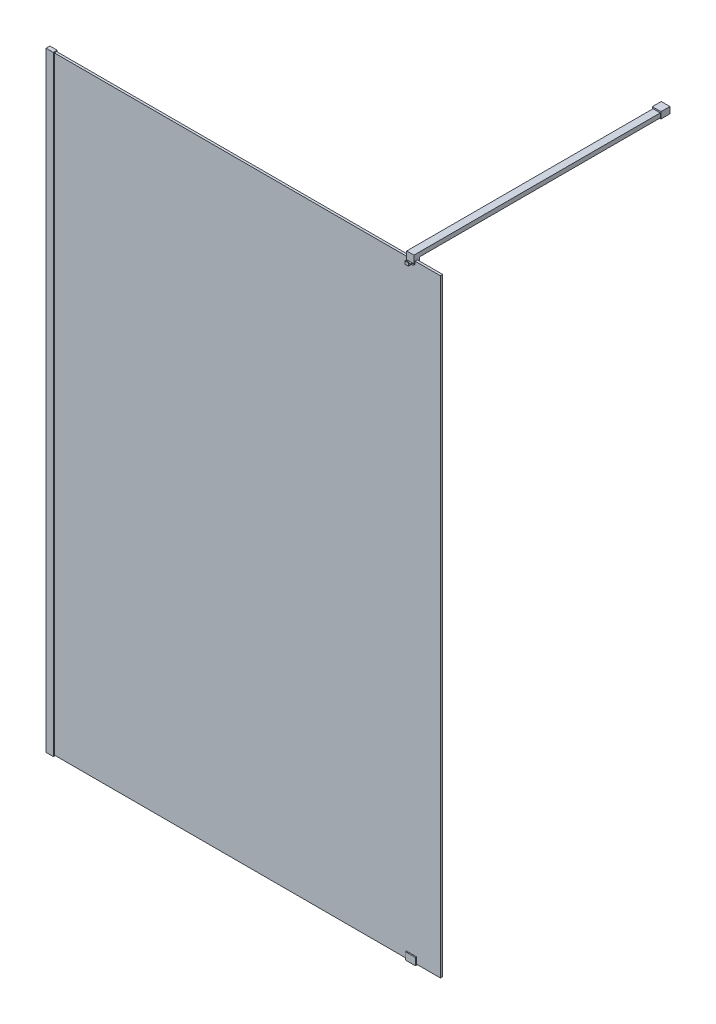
ISO-10303-21;
HEADER;
FILE_DESCRIPTION(('STEP AP214'),'2;1');
FILE_NAME('part.step','',(''),(''),'','','');
FILE_SCHEMA(('AUTOMOTIVE_DESIGN { 1 0 10303 214 1 1 1 1 }'));
ENDSEC;
DATA;
#1=APPLICATION_CONTEXT('core data for automotive mechanical design processes');
#2=APPLICATION_PROTOCOL_DEFINITION('international standard','automotive_design',2000,#1);
#3=PRODUCT_CONTEXT('',#1,'mechanical');
#4=PRODUCT('Part','Part','',(#3));
#5=PRODUCT_RELATED_PRODUCT_CATEGORY('part','',(#4));
#6=PRODUCT_DEFINITION_FORMATION('','',#4);
#7=PRODUCT_DEFINITION_CONTEXT('part definition',#1,'design');
#8=PRODUCT_DEFINITION('design','',#6,#7);
#9=PRODUCT_DEFINITION_SHAPE('','',#8);
#10=(LENGTH_UNIT() NAMED_UNIT(*) SI_UNIT(.MILLI.,.METRE.));
#11=(NAMED_UNIT(*) PLANE_ANGLE_UNIT() SI_UNIT($,.RADIAN.));
#12=(NAMED_UNIT(*) SI_UNIT($,.STERADIAN.) SOLID_ANGLE_UNIT());
#13=UNCERTAINTY_MEASURE_WITH_UNIT(LENGTH_MEASURE(1.E-05),#10,'distance_accuracy_value','');
#14=(GEOMETRIC_REPRESENTATION_CONTEXT(3) GLOBAL_UNCERTAINTY_ASSIGNED_CONTEXT((#13)) GLOBAL_UNIT_ASSIGNED_CONTEXT((#10,
#11,#12)) REPRESENTATION_CONTEXT('',''));
#15=CARTESIAN_POINT('',(0.,0.,0.));
#16=DIRECTION('',(0.,0.,1.));
#17=DIRECTION('',(1.,0.,0.));
#18=AXIS2_PLACEMENT_3D('',#15,#16,#17);
#19=CARTESIAN_POINT('',(1270.95,2090.,-19.4000000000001));
#20=DIRECTION('',(-1.,0.,0.));
#21=DIRECTION('',(0.,0.,1.));
#22=AXIS2_PLACEMENT_3D('',#19,#20,#21);
#23=PLANE('',#22);
#24=DIRECTION('',(0.,-1.,0.));
#25=VECTOR('',#24,1.);
#26=CARTESIAN_POINT('',(1270.95,2090.,-850.03));
#27=LINE('',#26,#25);
#28=CARTESIAN_POINT('',(1270.95,2120.,-850.03));
#29=VERTEX_POINT('',#28);
#30=CARTESIAN_POINT('',(1270.95,2105.,-850.03));
#31=VERTEX_POINT('',#30);
#32=EDGE_CURVE('E61',#29,#31,#27,.T.);
#33=ORIENTED_EDGE('',*,*,#32,.F.);
#34=DIRECTION('',(0.,0.,1.));
#35=VECTOR('',#34,1.);
#36=CARTESIAN_POINT('',(1270.95,2120.,0.599999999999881));
#37=LINE('',#36,#35);
#38=CARTESIAN_POINT('',(1270.95,2120.,0.599999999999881));
#39=VERTEX_POINT('',#38);
#40=EDGE_CURVE('E386',#29,#39,#37,.T.);
#41=ORIENTED_EDGE('',*,*,#40,.T.);
#42=DIRECTION('',(0.,-1.,0.));
#43=VECTOR('',#42,1.);
#44=CARTESIAN_POINT('',(1270.95,2094.,0.599999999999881));
#45=LINE('',#44,#43);
#46=CARTESIAN_POINT('',(1270.95,2094.,0.599999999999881));
#47=VERTEX_POINT('',#46);
#48=EDGE_CURVE('E388',#39,#47,#45,.T.);
#49=ORIENTED_EDGE('',*,*,#48,.T.);
#50=DIRECTION('',(0.,1.,0.));
#51=VECTOR('',#50,1.);
#52=CARTESIAN_POINT('',(1270.95,2090.,0.599999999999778));
#53=LINE('',#52,#51);
#54=CARTESIAN_POINT('',(1270.95,2090.,0.599999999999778));
#55=VERTEX_POINT('',#54);
#56=EDGE_CURVE('E332',#55,#47,#53,.T.);
#57=ORIENTED_EDGE('',*,*,#56,.F.);
#58=DIRECTION('',(0.,0.,-1.));
#59=VECTOR('',#58,1.);
#60=CARTESIAN_POINT('',(1270.95,2090.,-3.40000000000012));
#61=LINE('',#60,#59);
#62=CARTESIAN_POINT('',(1270.95,2090.,-3.40000000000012));
#63=VERTEX_POINT('',#62);
#64=EDGE_CURVE('E362',#55,#63,#61,.T.);
#65=ORIENTED_EDGE('',*,*,#64,.T.);
#66=DIRECTION('',(0.,1.,-1.30407837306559E-13));
#67=VECTOR('',#66,1.);
#68=CARTESIAN_POINT('',(1270.95,2100.,-3.40000000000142));
#69=LINE('',#68,#67);
#70=CARTESIAN_POINT('',(1270.95,2100.,-3.40000000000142));
#71=VERTEX_POINT('',#70);
#72=EDGE_CURVE('E392',#63,#71,#69,.T.);
#73=ORIENTED_EDGE('',*,*,#72,.T.);
#74=DIRECTION('',(0.,0.,-1.));
#75=VECTOR('',#74,1.);
#76=CARTESIAN_POINT('',(1270.95,2100.,-11.4000000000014));
#77=LINE('',#76,#75);
#78=CARTESIAN_POINT('',(1270.95,2100.,-11.4000000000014));
#79=VERTEX_POINT('',#78);
#80=EDGE_CURVE('E394',#71,#79,#77,.T.);
#81=ORIENTED_EDGE('',*,*,#80,.T.);
#82=DIRECTION('',(0.,-1.,1.30451205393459E-13));
#83=VECTOR('',#82,1.);
#84=CARTESIAN_POINT('',(1270.95,2090.,-11.4000000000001));
#85=LINE('',#84,#83);
#86=CARTESIAN_POINT('',(1270.95,2090.,-11.4000000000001));
#87=VERTEX_POINT('',#86);
#88=EDGE_CURVE('E395',#79,#87,#85,.T.);
#89=ORIENTED_EDGE('',*,*,#88,.T.);
#90=DIRECTION('',(0.,0.,-1.));
#91=VECTOR('',#90,1.);
#92=CARTESIAN_POINT('',(1270.95,2090.,-19.4000000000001));
#93=LINE('',#92,#91);
#94=CARTESIAN_POINT('',(1270.95,2090.,-19.4000000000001));
#95=VERTEX_POINT('',#94);
#96=EDGE_CURVE('E283',#87,#95,#93,.T.);
#97=ORIENTED_EDGE('',*,*,#96,.T.);
#98=DIRECTION('',(0.,1.,0.));
#99=VECTOR('',#98,1.);
#100=CARTESIAN_POINT('',(1270.95,2120.,-19.4000000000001));
#101=LINE('',#100,#99);
#102=CARTESIAN_POINT('',(1270.95,2105.,-19.4000000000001));
#103=VERTEX_POINT('',#102);
#104=EDGE_CURVE('E249',#95,#103,#101,.T.);
#105=ORIENTED_EDGE('',*,*,#104,.T.);
#106=DIRECTION('',(0.,0.,-1.));
#107=VECTOR('',#106,1.);
#108=CARTESIAN_POINT('',(1270.95,2105.,-881.03));
#109=LINE('',#108,#107);
#110=EDGE_CURVE('E248',#103,#31,#109,.T.);
#111=ORIENTED_EDGE('',*,*,#110,.T.);
#112=EDGE_LOOP('',(#33,#41,#49,#57,#65,#73,#81,#89,#97,#105,#111));
#113=FACE_BOUND('',#112,.T.);
#114=ADVANCED_FACE('F46',(#113),#23,.F.);
#115=CARTESIAN_POINT('',(1245.95,2090.,-19.4000000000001));
#116=DIRECTION('',(-1.,0.,0.));
#117=DIRECTION('',(0.,0.,1.));
#118=AXIS2_PLACEMENT_3D('',#115,#116,#117);
#119=PLANE('',#118);
#120=DIRECTION('',(0.,0.,1.));
#121=VECTOR('',#120,1.);
#122=CARTESIAN_POINT('',(1245.95,2120.,0.599999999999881));
#123=LINE('',#122,#121);
#124=CARTESIAN_POINT('',(1245.95,2120.,-850.03));
#125=VERTEX_POINT('',#124);
#126=CARTESIAN_POINT('',(1245.95,2120.,0.599999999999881));
#127=VERTEX_POINT('',#126);
#128=EDGE_CURVE('E272',#125,#127,#123,.T.);
#129=ORIENTED_EDGE('',*,*,#128,.F.);
#130=DIRECTION('',(0.,-1.,0.));
#131=VECTOR('',#130,1.);
#132=CARTESIAN_POINT('',(1245.95,2090.,-850.03));
#133=LINE('',#132,#131);
#134=CARTESIAN_POINT('',(1245.95,2105.,-850.03));
#135=VERTEX_POINT('',#134);
#136=EDGE_CURVE('E230',#125,#135,#133,.T.);
#137=ORIENTED_EDGE('',*,*,#136,.T.);
#138=DIRECTION('',(0.,0.,1.));
#139=VECTOR('',#138,1.);
#140=CARTESIAN_POINT('',(1245.95,2105.,-881.03));
#141=LINE('',#140,#139);
#142=CARTESIAN_POINT('',(1245.95,2105.,-19.4000000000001));
#143=VERTEX_POINT('',#142);
#144=EDGE_CURVE('E238',#135,#143,#141,.T.);
#145=ORIENTED_EDGE('',*,*,#144,.T.);
#146=DIRECTION('',(0.,1.,0.));
#147=VECTOR('',#146,1.);
#148=CARTESIAN_POINT('',(1245.95,2120.,-19.4000000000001));
#149=LINE('',#148,#147);
#150=CARTESIAN_POINT('',(1245.95,2090.,-19.4000000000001));
#151=VERTEX_POINT('',#150);
#152=EDGE_CURVE('E262',#151,#143,#149,.T.);
#153=ORIENTED_EDGE('',*,*,#152,.F.);
#154=DIRECTION('',(0.,0.,-1.));
#155=VECTOR('',#154,1.);
#156=CARTESIAN_POINT('',(1245.95,2090.,-19.4000000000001));
#157=LINE('',#156,#155);
#158=CARTESIAN_POINT('',(1245.95,2090.,-11.4000000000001));
#159=VERTEX_POINT('',#158);
#160=EDGE_CURVE('E296',#159,#151,#157,.T.);
#161=ORIENTED_EDGE('',*,*,#160,.F.);
#162=DIRECTION('',(0.,-1.,1.30451205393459E-13));
#163=VECTOR('',#162,1.);
#164=CARTESIAN_POINT('',(1245.95,2090.,-11.4000000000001));
#165=LINE('',#164,#163);
#166=CARTESIAN_POINT('',(1245.95,2100.,-11.4000000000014));
#167=VERTEX_POINT('',#166);
#168=EDGE_CURVE('E294',#167,#159,#165,.T.);
#169=ORIENTED_EDGE('',*,*,#168,.F.);
#170=DIRECTION('',(0.,0.,-1.));
#171=VECTOR('',#170,1.);
#172=CARTESIAN_POINT('',(1245.95,2100.,-11.4000000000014));
#173=LINE('',#172,#171);
#174=CARTESIAN_POINT('',(1245.95,2100.,-3.40000000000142));
#175=VERTEX_POINT('',#174);
#176=EDGE_CURVE('E292',#175,#167,#173,.T.);
#177=ORIENTED_EDGE('',*,*,#176,.F.);
#178=DIRECTION('',(0.,1.,-1.30407837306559E-13));
#179=VECTOR('',#178,1.);
#180=CARTESIAN_POINT('',(1245.95,2100.,-3.40000000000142));
#181=LINE('',#180,#179);
#182=CARTESIAN_POINT('',(1245.95,2090.,-3.40000000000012));
#183=VERTEX_POINT('',#182);
#184=EDGE_CURVE('E290',#183,#175,#181,.T.);
#185=ORIENTED_EDGE('',*,*,#184,.F.);
#186=DIRECTION('',(0.,0.,-1.));
#187=VECTOR('',#186,1.);
#188=CARTESIAN_POINT('',(1245.95,2090.,-3.40000000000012));
#189=LINE('',#188,#187);
#190=CARTESIAN_POINT('',(1245.95,2090.,0.599999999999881));
#191=VERTEX_POINT('',#190);
#192=EDGE_CURVE('E288',#191,#183,#189,.T.);
#193=ORIENTED_EDGE('',*,*,#192,.F.);
#194=DIRECTION('',(0.,1.,0.));
#195=VECTOR('',#194,1.);
#196=CARTESIAN_POINT('',(1245.95,2090.,0.599999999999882));
#197=LINE('',#196,#195);
#198=CARTESIAN_POINT('',(1245.95,2094.,0.599999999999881));
#199=VERTEX_POINT('',#198);
#200=EDGE_CURVE('E329',#191,#199,#197,.T.);
#201=ORIENTED_EDGE('',*,*,#200,.T.);
#202=DIRECTION('',(0.,-1.,0.));
#203=VECTOR('',#202,1.);
#204=CARTESIAN_POINT('',(1245.95,2094.,0.599999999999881));
#205=LINE('',#204,#203);
#206=EDGE_CURVE('E274',#127,#199,#205,.T.);
#207=ORIENTED_EDGE('',*,*,#206,.F.);
#208=EDGE_LOOP('',(#129,#137,#145,#153,#161,#169,#177,#185,#193,#201,#207));
#209=FACE_BOUND('',#208,.T.);
#210=ADVANCED_FACE('F259',(#209),#119,.T.);
#211=CARTESIAN_POINT('',(1270.95,2120.,0.599999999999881));
#212=DIRECTION('',(0.,-1.,0.));
#213=DIRECTION('',(0.,0.,-1.));
#214=AXIS2_PLACEMENT_3D('',#211,#212,#213);
#215=PLANE('',#214);
#216=DIRECTION('',(1.,0.,0.));
#217=VECTOR('',#216,1.);
#218=CARTESIAN_POINT('',(1270.95,2120.,-850.03));
#219=LINE('',#218,#217);
#220=EDGE_CURVE('E68',#125,#29,#219,.T.);
#221=ORIENTED_EDGE('',*,*,#220,.F.);
#222=ORIENTED_EDGE('',*,*,#128,.T.);
#223=DIRECTION('',(-1.,0.,0.));
#224=VECTOR('',#223,1.);
#225=CARTESIAN_POINT('',(1270.95,2120.,0.599999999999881));
#226=LINE('',#225,#224);
#227=EDGE_CURVE('E326',#39,#127,#226,.T.);
#228=ORIENTED_EDGE('',*,*,#227,.F.);
#229=ORIENTED_EDGE('',*,*,#40,.F.);
#230=EDGE_LOOP('',(#221,#222,#228,#229));
#231=FACE_BOUND('',#230,.T.);
#232=ADVANCED_FACE('F437',(#231),#215,.F.);
#233=CARTESIAN_POINT('',(1245.95,2105.,-19.4000000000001));
#234=DIRECTION('',(0.,1.,0.));
#235=DIRECTION('',(0.,0.,1.));
#236=AXIS2_PLACEMENT_3D('',#233,#234,#235);
#237=PLANE('',#236);
#238=DIRECTION('',(-1.,0.,0.));
#239=VECTOR('',#238,1.);
#240=CARTESIAN_POINT('',(1245.95,2105.,-850.03));
#241=LINE('',#240,#239);
#242=EDGE_CURVE('E12',#31,#135,#241,.T.);
#243=ORIENTED_EDGE('',*,*,#242,.F.);
#244=ORIENTED_EDGE('',*,*,#110,.F.);
#245=DIRECTION('',(1.,0.,0.));
#246=VECTOR('',#245,1.);
#247=CARTESIAN_POINT('',(1245.95,2105.,-19.4000000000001));
#248=LINE('',#247,#246);
#249=EDGE_CURVE('E244',#143,#103,#248,.T.);
#250=ORIENTED_EDGE('',*,*,#249,.F.);
#251=ORIENTED_EDGE('',*,*,#144,.F.);
#252=EDGE_LOOP('',(#243,#244,#250,#251));
#253=FACE_BOUND('',#252,.T.);
#254=ADVANCED_FACE('F265',(#253),#237,.F.);
#255=CARTESIAN_POINT('',(1270.95,2094.,9.84506801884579));
#256=DIRECTION('',(0.,-1.,0.));
#257=DIRECTION('',(0.,0.,-1.));
#258=AXIS2_PLACEMENT_3D('',#255,#256,#257);
#259=PLANE('',#258);
#260=DIRECTION('',(-0.906307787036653,0.,-0.422618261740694));
#261=VECTOR('',#260,1.);
#262=CARTESIAN_POINT('',(1270.02591161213,2094.,11.8267819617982));
#263=LINE('',#262,#261);
#264=CARTESIAN_POINT('',(1252.45,2094.,3.6309997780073));
#265=VERTEX_POINT('',#264);
#266=EDGE_CURVE('E365',#265,#199,#263,.T.);
#267=ORIENTED_EDGE('',*,*,#266,.F.);
#268=DIRECTION('',(0.,0.,-1.));
#269=VECTOR('',#268,1.);
#270=CARTESIAN_POINT('',(1252.45,2094.,9.84506801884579));
#271=LINE('',#270,#269);
#272=CARTESIAN_POINT('',(1252.45,2094.,9.84506801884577));
#273=VERTEX_POINT('',#272);
#274=EDGE_CURVE('E273',#273,#265,#271,.T.);
#275=ORIENTED_EDGE('',*,*,#274,.F.);
#276=DIRECTION('',(-1.,0.,0.));
#277=VECTOR('',#276,1.);
#278=CARTESIAN_POINT('',(1270.95,2094.,9.84506801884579));
#279=LINE('',#278,#277);
#280=CARTESIAN_POINT('',(1264.45,2094.,9.84506801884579));
#281=VERTEX_POINT('',#280);
#282=EDGE_CURVE('E320',#281,#273,#279,.T.);
#283=ORIENTED_EDGE('',*,*,#282,.F.);
#284=DIRECTION('',(0.,0.,1.));
#285=VECTOR('',#284,1.);
#286=CARTESIAN_POINT('',(1264.45,2094.,9.84506801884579));
#287=LINE('',#286,#285);
#288=CARTESIAN_POINT('',(1264.45,2094.,3.63099977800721));
#289=VERTEX_POINT('',#288);
#290=EDGE_CURVE('E379',#289,#281,#287,.T.);
#291=ORIENTED_EDGE('',*,*,#290,.F.);
#292=DIRECTION('',(-0.906307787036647,0.,0.422618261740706));
#293=VECTOR('',#292,1.);
#294=CARTESIAN_POINT('',(1267.40893350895,2094.,2.25122642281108));
#295=LINE('',#294,#293);
#296=EDGE_CURVE('E364',#47,#289,#295,.T.);
#297=ORIENTED_EDGE('',*,*,#296,.F.);
#298=DIRECTION('',(-1.,0.,0.));
#299=VECTOR('',#298,1.);
#300=CARTESIAN_POINT('',(1270.95,2094.,0.599999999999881));
#301=LINE('',#300,#299);
#302=EDGE_CURVE('E323',#47,#199,#301,.T.);
#303=ORIENTED_EDGE('',*,*,#302,.T.);
#304=EDGE_LOOP('',(#267,#275,#283,#291,#297,#303));
#305=FACE_BOUND('',#304,.T.);
#306=ADVANCED_FACE('F424',(#305),#259,.F.);
#307=CARTESIAN_POINT('',(1270.95,2100.,10.3700000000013));
#308=DIRECTION('',(0.,-0.087155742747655,0.996194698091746));
#309=DIRECTION('',(0.,-0.996194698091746,-0.087155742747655));
#310=AXIS2_PLACEMENT_3D('',#307,#308,#309);
#311=PLANE('',#310);
#312=DIRECTION('',(0.,-0.996194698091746,-0.087155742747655));
#313=VECTOR('',#312,1.);
#314=CARTESIAN_POINT('',(1252.45,2100.,10.3700000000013));
#315=LINE('',#314,#313);
#316=CARTESIAN_POINT('',(1252.45,2100.,10.3700000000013));
#317=VERTEX_POINT('',#316);
#318=EDGE_CURVE('E276',#317,#273,#315,.T.);
#319=ORIENTED_EDGE('',*,*,#318,.F.);
#320=DIRECTION('',(-1.,0.,0.));
#321=VECTOR('',#320,1.);
#322=CARTESIAN_POINT('',(1270.95,2100.,10.3700000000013));
#323=LINE('',#322,#321);
#324=CARTESIAN_POINT('',(1264.45,2100.,10.3700000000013));
#325=VERTEX_POINT('',#324);
#326=EDGE_CURVE('E317',#325,#317,#323,.T.);
#327=ORIENTED_EDGE('',*,*,#326,.F.);
#328=DIRECTION('',(0.,0.996194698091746,0.087155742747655));
#329=VECTOR('',#328,1.);
#330=CARTESIAN_POINT('',(1264.45,2100.,10.3700000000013));
#331=LINE('',#330,#329);
#332=EDGE_CURVE('E376',#281,#325,#331,.T.);
#333=ORIENTED_EDGE('',*,*,#332,.F.);
#334=ORIENTED_EDGE('',*,*,#282,.T.);
#335=EDGE_LOOP('',(#319,#327,#333,#334));
#336=FACE_BOUND('',#335,.T.);
#337=ADVANCED_FACE('F428',(#336),#311,.F.);
#338=CARTESIAN_POINT('',(1270.95,2100.,13.3700000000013));
#339=DIRECTION('',(0.,-1.,1.48029736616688E-13));
#340=DIRECTION('',(0.,-1.48029736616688E-13,-1.));
#341=AXIS2_PLACEMENT_3D('',#338,#339,#340);
#342=PLANE('',#341);
#343=DIRECTION('',(0.,-1.48029736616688E-13,-1.));
#344=VECTOR('',#343,1.);
#345=CARTESIAN_POINT('',(1252.45,2100.,13.3700000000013));
#346=LINE('',#345,#344);
#347=CARTESIAN_POINT('',(1252.45,2100.,13.3700000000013));
#348=VERTEX_POINT('',#347);
#349=EDGE_CURVE('E382',#348,#317,#346,.T.);
#350=ORIENTED_EDGE('',*,*,#349,.F.);
#351=DIRECTION('',(-1.,0.,0.));
#352=VECTOR('',#351,1.);
#353=CARTESIAN_POINT('',(1270.95,2100.,13.3700000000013));
#354=LINE('',#353,#352);
#355=CARTESIAN_POINT('',(1264.45,2100.,13.3700000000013));
#356=VERTEX_POINT('',#355);
#357=EDGE_CURVE('E314',#356,#348,#354,.T.);
#358=ORIENTED_EDGE('',*,*,#357,.F.);
#359=DIRECTION('',(0.,1.48029736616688E-13,1.));
#360=VECTOR('',#359,1.);
#361=CARTESIAN_POINT('',(1264.45,2100.,13.3700000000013));
#362=LINE('',#361,#360);
#363=EDGE_CURVE('E368',#325,#356,#362,.T.);
#364=ORIENTED_EDGE('',*,*,#363,.F.);
#365=ORIENTED_EDGE('',*,*,#326,.T.);
#366=EDGE_LOOP('',(#350,#358,#364,#365));
#367=FACE_BOUND('',#366,.T.);
#368=ADVANCED_FACE('F431',(#367),#342,.F.);
#369=CARTESIAN_POINT('',(1270.95,2090.,13.3700000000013));
#370=DIRECTION('',(0.,0.,-1.));
#371=DIRECTION('',(0.,1.,0.));
#372=AXIS2_PLACEMENT_3D('',#369,#370,#371);
#373=PLANE('',#372);
#374=ORIENTED_EDGE('',*,*,#357,.T.);
#375=DIRECTION('',(0.,-1.,0.));
#376=VECTOR('',#375,1.);
#377=CARTESIAN_POINT('',(1252.45,7879.54089163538,13.3700000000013));
#378=LINE('',#377,#376);
#379=CARTESIAN_POINT('',(1252.45,2090.,13.3700000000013));
#380=VERTEX_POINT('',#379);
#381=EDGE_CURVE('E345',#348,#380,#378,.T.);
#382=ORIENTED_EDGE('',*,*,#381,.T.);
#383=DIRECTION('',(-1.,0.,0.));
#384=VECTOR('',#383,1.);
#385=CARTESIAN_POINT('',(1270.95,2090.,13.3700000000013));
#386=LINE('',#385,#384);
#387=CARTESIAN_POINT('',(1264.45,2090.,13.3700000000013));
#388=VERTEX_POINT('',#387);
#389=EDGE_CURVE('E311',#388,#380,#386,.T.);
#390=ORIENTED_EDGE('',*,*,#389,.F.);
#391=DIRECTION('',(0.,-1.,0.));
#392=VECTOR('',#391,1.);
#393=CARTESIAN_POINT('',(1264.45,7879.54089163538,13.3700000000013));
#394=LINE('',#393,#392);
#395=EDGE_CURVE('E355',#356,#388,#394,.T.);
#396=ORIENTED_EDGE('',*,*,#395,.F.);
#397=EDGE_LOOP('',(#374,#382,#390,#396));
#398=FACE_BOUND('',#397,.T.);
#399=ADVANCED_FACE('F353',(#398),#373,.F.);
#400=CARTESIAN_POINT('',(1270.95,2090.,-3.40000000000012));
#401=DIRECTION('',(0.,1.,0.));
#402=DIRECTION('',(0.,0.,1.));
#403=AXIS2_PLACEMENT_3D('',#400,#401,#402);
#404=PLANE('',#403);
#405=DIRECTION('',(0.906307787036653,0.,0.422618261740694));
#406=VECTOR('',#405,1.);
#407=CARTESIAN_POINT('',(1264.95275623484,2090.,9.46113075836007));
#408=LINE('',#407,#406);
#409=CARTESIAN_POINT('',(1252.45,2090.,3.6309997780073));
#410=VERTEX_POINT('',#409);
#411=EDGE_CURVE('E370',#191,#410,#408,.T.);
#412=ORIENTED_EDGE('',*,*,#411,.F.);
#413=ORIENTED_EDGE('',*,*,#192,.T.);
#414=DIRECTION('',(-1.,0.,0.));
#415=VECTOR('',#414,1.);
#416=CARTESIAN_POINT('',(1270.95,2090.,-3.40000000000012));
#417=LINE('',#416,#415);
#418=EDGE_CURVE('E308',#63,#183,#417,.T.);
#419=ORIENTED_EDGE('',*,*,#418,.F.);
#420=ORIENTED_EDGE('',*,*,#64,.F.);
#421=DIRECTION('',(0.906307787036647,0.,-0.422618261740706));
#422=VECTOR('',#421,1.);
#423=CARTESIAN_POINT('',(1272.48208888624,2090.,-0.114424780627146));
#424=LINE('',#423,#422);
#425=CARTESIAN_POINT('',(1264.45,2090.,3.6309997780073));
#426=VERTEX_POINT('',#425);
#427=EDGE_CURVE('E360',#426,#55,#424,.T.);
#428=ORIENTED_EDGE('',*,*,#427,.F.);
#429=DIRECTION('',(0.,0.,-1.));
#430=VECTOR('',#429,1.);
#431=CARTESIAN_POINT('',(1264.45,2090.,-3.40000000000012));
#432=LINE('',#431,#430);
#433=EDGE_CURVE('E334',#388,#426,#432,.T.);
#434=ORIENTED_EDGE('',*,*,#433,.F.);
#435=ORIENTED_EDGE('',*,*,#389,.T.);
#436=DIRECTION('',(0.,0.,1.));
#437=VECTOR('',#436,1.);
#438=CARTESIAN_POINT('',(1252.45,2090.,-3.40000000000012));
#439=LINE('',#438,#437);
#440=EDGE_CURVE('E54',#410,#380,#439,.T.);
#441=ORIENTED_EDGE('',*,*,#440,.F.);
#442=EDGE_LOOP('',(#412,#413,#419,#420,#428,#434,#435,#441));
#443=FACE_BOUND('',#442,.T.);
#444=ADVANCED_FACE('F357',(#443),#404,.F.);
#445=CARTESIAN_POINT('',(1270.95,2120.,-19.4000000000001));
#446=DIRECTION('',(0.,0.,1.));
#447=DIRECTION('',(0.,-1.,0.));
#448=AXIS2_PLACEMENT_3D('',#445,#446,#447);
#449=PLANE('',#448);
#450=ORIENTED_EDGE('',*,*,#152,.T.);
#451=ORIENTED_EDGE('',*,*,#249,.T.);
#452=ORIENTED_EDGE('',*,*,#104,.F.);
#453=DIRECTION('',(-1.,0.,0.));
#454=VECTOR('',#453,1.);
#455=CARTESIAN_POINT('',(1270.95,2090.,-19.4000000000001));
#456=LINE('',#455,#454);
#457=EDGE_CURVE('E271',#95,#151,#456,.T.);
#458=ORIENTED_EDGE('',*,*,#457,.T.);
#459=EDGE_LOOP('',(#450,#451,#452,#458));
#460=FACE_BOUND('',#459,.T.);
#461=ADVANCED_FACE('F48',(#460),#449,.F.);
#462=CARTESIAN_POINT('',(1270.95,2094.,0.599999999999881));
#463=DIRECTION('',(0.,0.,-1.));
#464=DIRECTION('',(0.,1.,0.));
#465=AXIS2_PLACEMENT_3D('',#462,#463,#464);
#466=PLANE('',#465);
#467=ORIENTED_EDGE('',*,*,#206,.T.);
#468=ORIENTED_EDGE('',*,*,#302,.F.);
#469=ORIENTED_EDGE('',*,*,#48,.F.);
#470=ORIENTED_EDGE('',*,*,#227,.T.);
#471=EDGE_LOOP('',(#467,#468,#469,#470));
#472=FACE_BOUND('',#471,.T.);
#473=ADVANCED_FACE('F435',(#472),#466,.F.);
#474=CARTESIAN_POINT('',(1270.95,2100.,-3.40000000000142));
#475=DIRECTION('',(0.,1.30407837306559E-13,1.));
#476=DIRECTION('',(0.,-1.,1.30407837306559E-13));
#477=AXIS2_PLACEMENT_3D('',#474,#475,#476);
#478=PLANE('',#477);
#479=ORIENTED_EDGE('',*,*,#184,.T.);
#480=DIRECTION('',(-1.,0.,0.));
#481=VECTOR('',#480,1.);
#482=CARTESIAN_POINT('',(1270.95,2100.,-3.40000000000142));
#483=LINE('',#482,#481);
#484=EDGE_CURVE('E305',#71,#175,#483,.T.);
#485=ORIENTED_EDGE('',*,*,#484,.F.);
#486=ORIENTED_EDGE('',*,*,#72,.F.);
#487=ORIENTED_EDGE('',*,*,#418,.T.);
#488=EDGE_LOOP('',(#479,#485,#486,#487));
#489=FACE_BOUND('',#488,.T.);
#490=ADVANCED_FACE('F413',(#489),#478,.F.);
#491=CARTESIAN_POINT('',(1270.95,2100.,-11.4000000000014));
#492=DIRECTION('',(0.,1.,0.));
#493=DIRECTION('',(0.,0.,1.));
#494=AXIS2_PLACEMENT_3D('',#491,#492,#493);
#495=PLANE('',#494);
#496=ORIENTED_EDGE('',*,*,#176,.T.);
#497=DIRECTION('',(-1.,0.,0.));
#498=VECTOR('',#497,1.);
#499=CARTESIAN_POINT('',(1270.95,2100.,-11.4000000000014));
#500=LINE('',#499,#498);
#501=EDGE_CURVE('E302',#79,#167,#500,.T.);
#502=ORIENTED_EDGE('',*,*,#501,.F.);
#503=ORIENTED_EDGE('',*,*,#80,.F.);
#504=ORIENTED_EDGE('',*,*,#484,.T.);
#505=EDGE_LOOP('',(#496,#502,#503,#504));
#506=FACE_BOUND('',#505,.T.);
#507=ADVANCED_FACE('F409',(#506),#495,.F.);
#508=CARTESIAN_POINT('',(1270.95,2090.,-11.4000000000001));
#509=DIRECTION('',(0.,-1.30451205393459E-13,-1.));
#510=DIRECTION('',(0.,1.,-1.30451205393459E-13));
#511=AXIS2_PLACEMENT_3D('',#508,#509,#510);
#512=PLANE('',#511);
#513=ORIENTED_EDGE('',*,*,#168,.T.);
#514=DIRECTION('',(-1.,0.,0.));
#515=VECTOR('',#514,1.);
#516=CARTESIAN_POINT('',(1270.95,2090.,-11.4000000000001));
#517=LINE('',#516,#515);
#518=EDGE_CURVE('E299',#87,#159,#517,.T.);
#519=ORIENTED_EDGE('',*,*,#518,.F.);
#520=ORIENTED_EDGE('',*,*,#88,.F.);
#521=ORIENTED_EDGE('',*,*,#501,.T.);
#522=EDGE_LOOP('',(#513,#519,#520,#521));
#523=FACE_BOUND('',#522,.T.);
#524=ADVANCED_FACE('F405',(#523),#512,.F.);
#525=CARTESIAN_POINT('',(1270.95,2090.,-19.4000000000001));
#526=DIRECTION('',(0.,1.,0.));
#527=DIRECTION('',(0.,0.,1.));
#528=AXIS2_PLACEMENT_3D('',#525,#526,#527);
#529=PLANE('',#528);
#530=ORIENTED_EDGE('',*,*,#160,.T.);
#531=ORIENTED_EDGE('',*,*,#457,.F.);
#532=ORIENTED_EDGE('',*,*,#96,.F.);
#533=ORIENTED_EDGE('',*,*,#518,.T.);
#534=EDGE_LOOP('',(#530,#531,#532,#533));
#535=FACE_BOUND('',#534,.T.);
#536=ADVANCED_FACE('F400',(#535),#529,.F.);
#537=CARTESIAN_POINT('',(1245.95,7879.54089163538,0.599999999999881));
#538=DIRECTION('',(-0.422618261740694,0.,0.906307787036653));
#539=DIRECTION('',(0.906307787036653,0.,0.422618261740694));
#540=AXIS2_PLACEMENT_3D('',#537,#538,#539);
#541=PLANE('',#540);
#542=DIRECTION('',(0.,-1.,0.));
#543=VECTOR('',#542,1.);
#544=CARTESIAN_POINT('',(1252.45,7879.54089163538,3.6309997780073));
#545=LINE('',#544,#543);
#546=EDGE_CURVE('E348',#265,#410,#545,.T.);
#547=ORIENTED_EDGE('',*,*,#546,.F.);
#548=ORIENTED_EDGE('',*,*,#266,.T.);
#549=ORIENTED_EDGE('',*,*,#200,.F.);
#550=ORIENTED_EDGE('',*,*,#411,.T.);
#551=EDGE_LOOP('',(#547,#548,#549,#550));
#552=FACE_BOUND('',#551,.T.);
#553=ADVANCED_FACE('F432',(#552),#541,.T.);
#554=CARTESIAN_POINT('',(1252.45,7879.54089163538,3.6309997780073));
#555=DIRECTION('',(-1.,0.,0.));
#556=DIRECTION('',(0.,0.,1.));
#557=AXIS2_PLACEMENT_3D('',#554,#555,#556);
#558=PLANE('',#557);
#559=ORIENTED_EDGE('',*,*,#318,.T.);
#560=ORIENTED_EDGE('',*,*,#274,.T.);
#561=ORIENTED_EDGE('',*,*,#546,.T.);
#562=ORIENTED_EDGE('',*,*,#440,.T.);
#563=ORIENTED_EDGE('',*,*,#381,.F.);
#564=ORIENTED_EDGE('',*,*,#349,.T.);
#565=EDGE_LOOP('',(#559,#560,#561,#562,#563,#564));
#566=FACE_BOUND('',#565,.T.);
#567=ADVANCED_FACE('F344',(#566),#558,.T.);
#568=CARTESIAN_POINT('',(1264.45,7879.54089163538,3.6309997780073));
#569=DIRECTION('',(1.,0.,0.));
#570=DIRECTION('',(0.,0.,-1.));
#571=AXIS2_PLACEMENT_3D('',#568,#569,#570);
#572=PLANE('',#571);
#573=DIRECTION('',(0.,-1.,0.));
#574=VECTOR('',#573,1.);
#575=CARTESIAN_POINT('',(1264.45,7879.54089163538,3.6309997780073));
#576=LINE('',#575,#574);
#577=EDGE_CURVE('E241',#289,#426,#576,.T.);
#578=ORIENTED_EDGE('',*,*,#577,.F.);
#579=ORIENTED_EDGE('',*,*,#290,.T.);
#580=ORIENTED_EDGE('',*,*,#332,.T.);
#581=ORIENTED_EDGE('',*,*,#363,.T.);
#582=ORIENTED_EDGE('',*,*,#395,.T.);
#583=ORIENTED_EDGE('',*,*,#433,.T.);
#584=EDGE_LOOP('',(#578,#579,#580,#581,#582,#583));
#585=FACE_BOUND('',#584,.T.);
#586=ADVANCED_FACE('F420',(#585),#572,.T.);
#587=CARTESIAN_POINT('',(1270.95,7879.54089163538,0.599999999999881));
#588=DIRECTION('',(0.422618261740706,0.,0.906307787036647));
#589=DIRECTION('',(0.906307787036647,0.,-0.422618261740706));
#590=AXIS2_PLACEMENT_3D('',#587,#588,#589);
#591=PLANE('',#590);
#592=ORIENTED_EDGE('',*,*,#56,.T.);
#593=ORIENTED_EDGE('',*,*,#296,.T.);
#594=ORIENTED_EDGE('',*,*,#577,.T.);
#595=ORIENTED_EDGE('',*,*,#427,.T.);
#596=EDGE_LOOP('',(#592,#593,#594,#595));
#597=FACE_BOUND('',#596,.T.);
#598=ADVANCED_FACE('F418',(#597),#591,.T.);
#599=CARTESIAN_POINT('',(1243.44999999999,2103.,-850.03));
#600=DIRECTION('',(0.,0.,-1.));
#601=DIRECTION('',(-1.,0.,0.));
#602=AXIS2_PLACEMENT_3D('',#599,#600,#601);
#603=PLANE('',#602);
#604=DIRECTION('',(0.,1.,0.));
#605=VECTOR('',#604,1.);
#606=CARTESIAN_POINT('',(1243.44999999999,2125.,-850.03));
#607=LINE('',#606,#605);
#608=CARTESIAN_POINT('',(1243.44999999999,2103.,-850.03));
#609=VERTEX_POINT('',#608);
#610=CARTESIAN_POINT('',(1243.44999999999,2125.,-850.03));
#611=VERTEX_POINT('',#610);
#612=EDGE_CURVE('E209',#609,#611,#607,.T.);
#613=ORIENTED_EDGE('',*,*,#612,.F.);
#614=DIRECTION('',(-1.,0.,0.));
#615=VECTOR('',#614,1.);
#616=CARTESIAN_POINT('',(1273.44999999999,2103.,-850.03));
#617=LINE('',#616,#615);
#618=CARTESIAN_POINT('',(1273.44999999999,2103.,-850.03));
#619=VERTEX_POINT('',#618);
#620=EDGE_CURVE('E201',#619,#609,#617,.T.);
#621=ORIENTED_EDGE('',*,*,#620,.F.);
#622=DIRECTION('',(0.,-1.,0.));
#623=VECTOR('',#622,1.);
#624=CARTESIAN_POINT('',(1273.44999999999,2125.,-850.03));
#625=LINE('',#624,#623);
#626=CARTESIAN_POINT('',(1273.44999999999,2125.,-850.03));
#627=VERTEX_POINT('',#626);
#628=EDGE_CURVE('E212',#627,#619,#625,.T.);
#629=ORIENTED_EDGE('',*,*,#628,.F.);
#630=DIRECTION('',(1.,0.,0.));
#631=VECTOR('',#630,1.);
#632=CARTESIAN_POINT('',(1273.44999999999,2125.,-850.03));
#633=LINE('',#632,#631);
#634=EDGE_CURVE('E193',#611,#627,#633,.T.);
#635=ORIENTED_EDGE('',*,*,#634,.F.);
#636=EDGE_LOOP('',(#613,#621,#629,#635));
#637=FACE_BOUND('',#636,.T.);
#638=ORIENTED_EDGE('',*,*,#136,.F.);
#639=ORIENTED_EDGE('',*,*,#220,.T.);
#640=ORIENTED_EDGE('',*,*,#32,.T.);
#641=ORIENTED_EDGE('',*,*,#242,.T.);
#642=EDGE_LOOP('',(#638,#639,#640,#641));
#643=FACE_BOUND('',#642,.T.);
#644=ADVANCED_FACE('F206',(#637,#643),#603,.F.);
#645=CARTESIAN_POINT('',(1243.44999999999,2125.,-850.03));
#646=DIRECTION('',(-1.,0.,0.));
#647=DIRECTION('',(0.,0.,1.));
#648=AXIS2_PLACEMENT_3D('',#645,#646,#647);
#649=PLANE('',#648);
#650=DIRECTION('',(0.,1.,0.));
#651=VECTOR('',#650,1.);
#652=CARTESIAN_POINT('',(1243.44999999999,2125.,-881.03));
#653=LINE('',#652,#651);
#654=CARTESIAN_POINT('',(1243.44999999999,2103.,-881.03));
#655=VERTEX_POINT('',#654);
#656=CARTESIAN_POINT('',(1243.44999999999,2125.,-881.03));
#657=VERTEX_POINT('',#656);
#658=EDGE_CURVE('E224',#655,#657,#653,.T.);
#659=ORIENTED_EDGE('',*,*,#658,.F.);
#660=DIRECTION('',(0.,0.,-1.));
#661=VECTOR('',#660,1.);
#662=CARTESIAN_POINT('',(1243.44999999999,2103.,-850.03));
#663=LINE('',#662,#661);
#664=EDGE_CURVE('E215',#609,#655,#663,.T.);
#665=ORIENTED_EDGE('',*,*,#664,.F.);
#666=ORIENTED_EDGE('',*,*,#612,.T.);
#667=DIRECTION('',(0.,0.,-1.));
#668=VECTOR('',#667,1.);
#669=CARTESIAN_POINT('',(1243.44999999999,2125.,-850.03));
#670=LINE('',#669,#668);
#671=EDGE_CURVE('E190',#611,#657,#670,.T.);
#672=ORIENTED_EDGE('',*,*,#671,.T.);
#673=EDGE_LOOP('',(#659,#665,#666,#672));
#674=FACE_BOUND('',#673,.T.);
#675=ADVANCED_FACE('F214',(#674),#649,.T.);
#676=CARTESIAN_POINT('',(1273.44999999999,2103.,-850.03));
#677=DIRECTION('',(0.,-1.,0.));
#678=DIRECTION('',(0.,0.,-1.));
#679=AXIS2_PLACEMENT_3D('',#676,#677,#678);
#680=PLANE('',#679);
#681=DIRECTION('',(-1.,0.,0.));
#682=VECTOR('',#681,1.);
#683=CARTESIAN_POINT('',(1273.44999999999,2103.,-881.03));
#684=LINE('',#683,#682);
#685=CARTESIAN_POINT('',(1273.44999999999,2103.,-881.03));
#686=VERTEX_POINT('',#685);
#687=EDGE_CURVE('E216',#686,#655,#684,.T.);
#688=ORIENTED_EDGE('',*,*,#687,.F.);
#689=DIRECTION('',(0.,0.,-1.));
#690=VECTOR('',#689,1.);
#691=CARTESIAN_POINT('',(1273.44999999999,2103.,-850.03));
#692=LINE('',#691,#690);
#693=EDGE_CURVE('E231',#619,#686,#692,.T.);
#694=ORIENTED_EDGE('',*,*,#693,.F.);
#695=ORIENTED_EDGE('',*,*,#620,.T.);
#696=ORIENTED_EDGE('',*,*,#664,.T.);
#697=EDGE_LOOP('',(#688,#694,#695,#696));
#698=FACE_BOUND('',#697,.T.);
#699=ADVANCED_FACE('F444',(#698),#680,.T.);
#700=CARTESIAN_POINT('',(1273.44999999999,2125.,-850.03));
#701=DIRECTION('',(1.,0.,0.));
#702=DIRECTION('',(0.,1.,0.));
#703=AXIS2_PLACEMENT_3D('',#700,#701,#702);
#704=PLANE('',#703);
#705=DIRECTION('',(0.,-1.,0.));
#706=VECTOR('',#705,1.);
#707=CARTESIAN_POINT('',(1273.44999999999,2125.,-881.03));
#708=LINE('',#707,#706);
#709=CARTESIAN_POINT('',(1273.44999999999,2125.,-881.03));
#710=VERTEX_POINT('',#709);
#711=EDGE_CURVE('E219',#710,#686,#708,.T.);
#712=ORIENTED_EDGE('',*,*,#711,.F.);
#713=DIRECTION('',(0.,0.,-1.));
#714=VECTOR('',#713,1.);
#715=CARTESIAN_POINT('',(1273.44999999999,2125.,-850.03));
#716=LINE('',#715,#714);
#717=EDGE_CURVE('E200',#627,#710,#716,.T.);
#718=ORIENTED_EDGE('',*,*,#717,.F.);
#719=ORIENTED_EDGE('',*,*,#628,.T.);
#720=ORIENTED_EDGE('',*,*,#693,.T.);
#721=EDGE_LOOP('',(#712,#718,#719,#720));
#722=FACE_BOUND('',#721,.T.);
#723=ADVANCED_FACE('F612',(#722),#704,.T.);
#724=CARTESIAN_POINT('',(1273.44999999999,2125.,-850.03));
#725=DIRECTION('',(0.,1.,0.));
#726=DIRECTION('',(0.,0.,1.));
#727=AXIS2_PLACEMENT_3D('',#724,#725,#726);
#728=PLANE('',#727);
#729=DIRECTION('',(1.,0.,0.));
#730=VECTOR('',#729,1.);
#731=CARTESIAN_POINT('',(1273.44999999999,2125.,-881.03));
#732=LINE('',#731,#730);
#733=EDGE_CURVE('E195',#657,#710,#732,.T.);
#734=ORIENTED_EDGE('',*,*,#733,.F.);
#735=ORIENTED_EDGE('',*,*,#671,.F.);
#736=ORIENTED_EDGE('',*,*,#634,.T.);
#737=ORIENTED_EDGE('',*,*,#717,.T.);
#738=EDGE_LOOP('',(#734,#735,#736,#737));
#739=FACE_BOUND('',#738,.T.);
#740=ADVANCED_FACE('F192',(#739),#728,.T.);
#741=CARTESIAN_POINT('',(1245.95,2105.,-881.03));
#742=DIRECTION('',(0.,0.,-1.));
#743=DIRECTION('',(-1.,0.,0.));
#744=AXIS2_PLACEMENT_3D('',#741,#742,#743);
#745=PLANE('',#744);
#746=ORIENTED_EDGE('',*,*,#658,.T.);
#747=ORIENTED_EDGE('',*,*,#733,.T.);
#748=ORIENTED_EDGE('',*,*,#711,.T.);
#749=ORIENTED_EDGE('',*,*,#687,.T.);
#750=EDGE_LOOP('',(#746,#747,#748,#749));
#751=FACE_BOUND('',#750,.T.);
#752=ADVANCED_FACE('F485',(#751),#745,.T.);
#753=CLOSED_SHELL('',(#114,#210,#232,#254,#306,#337,#368,#399,#444,#461,#473,#490,#507,#524,
#536,#553,#567,#586,#598,#644,#675,#699,#723,#740,#752));
#754=MANIFOLD_SOLID_BREP('B2',#753);
#755=CARTESIAN_POINT('',(1275.95,22.,-11.4000000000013));
#756=DIRECTION('',(0.,0.,-1.));
#757=DIRECTION('',(0.,1.,0.));
#758=AXIS2_PLACEMENT_3D('',#755,#756,#757);
#759=PLANE('',#758);
#760=DIRECTION('',(0.,-1.,0.));
#761=VECTOR('',#760,1.);
#762=CARTESIAN_POINT('',(1240.95,22.,-11.4000000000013));
#763=LINE('',#762,#761);
#764=CARTESIAN_POINT('',(1240.95,22.,-11.4000000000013));
#765=VERTEX_POINT('',#764);
#766=CARTESIAN_POINT('',(1240.95,0.,-11.4));
#767=VERTEX_POINT('',#766);
#768=EDGE_CURVE('E765',#765,#767,#763,.T.);
#769=ORIENTED_EDGE('',*,*,#768,.T.);
#770=DIRECTION('',(-1.,0.,0.));
#771=VECTOR('',#770,1.);
#772=CARTESIAN_POINT('',(1275.95,0.,-11.4));
#773=LINE('',#772,#771);
#774=CARTESIAN_POINT('',(1275.95,0.,-11.4));
#775=VERTEX_POINT('',#774);
#776=EDGE_CURVE('E44',#775,#767,#773,.T.);
#777=ORIENTED_EDGE('',*,*,#776,.F.);
#778=DIRECTION('',(0.,-1.,0.));
#779=VECTOR('',#778,1.);
#780=CARTESIAN_POINT('',(1275.95,22.,-11.4000000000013));
#781=LINE('',#780,#779);
#782=CARTESIAN_POINT('',(1275.95,22.,-11.4000000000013));
#783=VERTEX_POINT('',#782);
#784=EDGE_CURVE('E779',#783,#775,#781,.T.);
#785=ORIENTED_EDGE('',*,*,#784,.F.);
#786=DIRECTION('',(-1.,0.,0.));
#787=VECTOR('',#786,1.);
#788=CARTESIAN_POINT('',(1275.95,22.,-11.4000000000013));
#789=LINE('',#788,#787);
#790=EDGE_CURVE('E761',#783,#765,#789,.T.);
#791=ORIENTED_EDGE('',*,*,#790,.T.);
#792=EDGE_LOOP('',(#769,#777,#785,#791));
#793=FACE_BOUND('',#792,.T.);
#794=ADVANCED_FACE('F669',(#793),#759,.F.);
#795=CARTESIAN_POINT('',(1275.95,0.,-11.4));
#796=DIRECTION('',(0.,-1.,0.));
#797=DIRECTION('',(0.,0.,-1.));
#798=AXIS2_PLACEMENT_3D('',#795,#796,#797);
#799=PLANE('',#798);
#800=DIRECTION('',(0.,0.,1.));
#801=VECTOR('',#800,1.);
#802=CARTESIAN_POINT('',(1240.95,0.,-11.4));
#803=LINE('',#802,#801);
#804=CARTESIAN_POINT('',(1240.95,0.,-3.40000000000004));
#805=VERTEX_POINT('',#804);
#806=EDGE_CURVE('E768',#767,#805,#803,.T.);
#807=ORIENTED_EDGE('',*,*,#806,.T.);
#808=DIRECTION('',(-1.,0.,0.));
#809=VECTOR('',#808,1.);
#810=CARTESIAN_POINT('',(1275.95,0.,-3.40000000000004));
#811=LINE('',#810,#809);
#812=CARTESIAN_POINT('',(1275.95,0.,-3.40000000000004));
#813=VERTEX_POINT('',#812);
#814=EDGE_CURVE('E677',#813,#805,#811,.T.);
#815=ORIENTED_EDGE('',*,*,#814,.F.);
#816=DIRECTION('',(0.,0.,1.));
#817=VECTOR('',#816,1.);
#818=CARTESIAN_POINT('',(1275.95,0.,-11.4));
#819=LINE('',#818,#817);
#820=EDGE_CURVE('E728',#775,#813,#819,.T.);
#821=ORIENTED_EDGE('',*,*,#820,.F.);
#822=ORIENTED_EDGE('',*,*,#776,.T.);
#823=EDGE_LOOP('',(#807,#815,#821,#822));
#824=FACE_BOUND('',#823,.T.);
#825=ADVANCED_FACE('F814',(#824),#799,.F.);
#826=CARTESIAN_POINT('',(1275.95,0.,-3.40000000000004));
#827=DIRECTION('',(0.,0.,1.));
#828=DIRECTION('',(0.,-1.,0.));
#829=AXIS2_PLACEMENT_3D('',#826,#827,#828);
#830=PLANE('',#829);
#831=DIRECTION('',(0.,1.,0.));
#832=VECTOR('',#831,1.);
#833=CARTESIAN_POINT('',(1240.95,0.,-3.40000000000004));
#834=LINE('',#833,#832);
#835=CARTESIAN_POINT('',(1240.95,21.9999999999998,-3.4000000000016));
#836=VERTEX_POINT('',#835);
#837=EDGE_CURVE('E770',#805,#836,#834,.T.);
#838=ORIENTED_EDGE('',*,*,#837,.T.);
#839=DIRECTION('',(-1.,0.,0.));
#840=VECTOR('',#839,1.);
#841=CARTESIAN_POINT('',(1275.95,21.9999999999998,-3.4000000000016));
#842=LINE('',#841,#840);
#843=CARTESIAN_POINT('',(1275.95,21.9999999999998,-3.4000000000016));
#844=VERTEX_POINT('',#843);
#845=EDGE_CURVE('E786',#844,#836,#842,.T.);
#846=ORIENTED_EDGE('',*,*,#845,.F.);
#847=DIRECTION('',(0.,1.,0.));
#848=VECTOR('',#847,1.);
#849=CARTESIAN_POINT('',(1275.95,0.,-3.40000000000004));
#850=LINE('',#849,#848);
#851=EDGE_CURVE('E794',#813,#844,#850,.T.);
#852=ORIENTED_EDGE('',*,*,#851,.F.);
#853=ORIENTED_EDGE('',*,*,#814,.T.);
#854=EDGE_LOOP('',(#838,#846,#852,#853));
#855=FACE_BOUND('',#854,.T.);
#856=ADVANCED_FACE('F792',(#855),#830,.F.);
#857=CARTESIAN_POINT('',(1275.95,22.,0.349999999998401));
#858=DIRECTION('',(0.,-1.,0.));
#859=DIRECTION('',(0.,0.,-1.));
#860=AXIS2_PLACEMENT_3D('',#857,#858,#859);
#861=PLANE('',#860);
#862=DIRECTION('',(0.,0.,1.));
#863=VECTOR('',#862,1.);
#864=CARTESIAN_POINT('',(1240.95,22.,0.349999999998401));
#865=LINE('',#864,#863);
#866=CARTESIAN_POINT('',(1240.95,22.,0.349999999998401));
#867=VERTEX_POINT('',#866);
#868=EDGE_CURVE('E772',#836,#867,#865,.T.);
#869=ORIENTED_EDGE('',*,*,#868,.T.);
#870=DIRECTION('',(-1.,0.,0.));
#871=VECTOR('',#870,1.);
#872=CARTESIAN_POINT('',(1275.95,22.,0.349999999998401));
#873=LINE('',#872,#871);
#874=CARTESIAN_POINT('',(1275.95,22.,0.349999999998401));
#875=VERTEX_POINT('',#874);
#876=EDGE_CURVE('E783',#875,#867,#873,.T.);
#877=ORIENTED_EDGE('',*,*,#876,.F.);
#878=DIRECTION('',(0.,0.,1.));
#879=VECTOR('',#878,1.);
#880=CARTESIAN_POINT('',(1275.95,22.,0.349999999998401));
#881=LINE('',#880,#879);
#882=EDGE_CURVE('E806',#844,#875,#881,.T.);
#883=ORIENTED_EDGE('',*,*,#882,.F.);
#884=ORIENTED_EDGE('',*,*,#845,.T.);
#885=EDGE_LOOP('',(#869,#877,#883,#884));
#886=FACE_BOUND('',#885,.T.);
#887=ADVANCED_FACE('F802',(#886),#861,.F.);
#888=CARTESIAN_POINT('',(1275.95,-3.,0.349999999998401));
#889=DIRECTION('',(0.,0.,-1.));
#890=DIRECTION('',(-1.,0.,0.));
#891=AXIS2_PLACEMENT_3D('',#888,#889,#890);
#892=PLANE('',#891);
#893=DIRECTION('',(0.,-1.,0.));
#894=VECTOR('',#893,1.);
#895=CARTESIAN_POINT('',(1240.95,-3.,0.349999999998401));
#896=LINE('',#895,#894);
#897=CARTESIAN_POINT('',(1240.95,-3.,0.349999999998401));
#898=VERTEX_POINT('',#897);
#899=EDGE_CURVE('E774',#867,#898,#896,.T.);
#900=ORIENTED_EDGE('',*,*,#899,.T.);
#901=DIRECTION('',(-1.,0.,0.));
#902=VECTOR('',#901,1.);
#903=CARTESIAN_POINT('',(1275.95,-3.,0.349999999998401));
#904=LINE('',#903,#902);
#905=CARTESIAN_POINT('',(1275.95,-3.,0.349999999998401));
#906=VERTEX_POINT('',#905);
#907=EDGE_CURVE('E756',#906,#898,#904,.T.);
#908=ORIENTED_EDGE('',*,*,#907,.F.);
#909=DIRECTION('',(0.,-1.,0.));
#910=VECTOR('',#909,1.);
#911=CARTESIAN_POINT('',(1275.95,-3.,0.349999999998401));
#912=LINE('',#911,#910);
#913=EDGE_CURVE('E747',#875,#906,#912,.T.);
#914=ORIENTED_EDGE('',*,*,#913,.F.);
#915=ORIENTED_EDGE('',*,*,#876,.T.);
#916=EDGE_LOOP('',(#900,#908,#914,#915));
#917=FACE_BOUND('',#916,.T.);
#918=ADVANCED_FACE('F805',(#917),#892,.F.);
#919=CARTESIAN_POINT('',(1275.95,-3.,-15.7500000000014));
#920=DIRECTION('',(0.,1.,0.));
#921=DIRECTION('',(0.,0.,1.));
#922=AXIS2_PLACEMENT_3D('',#919,#920,#921);
#923=PLANE('',#922);
#924=DIRECTION('',(0.,0.,-1.));
#925=VECTOR('',#924,1.);
#926=CARTESIAN_POINT('',(1240.95,-3.,-15.7500000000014));
#927=LINE('',#926,#925);
#928=CARTESIAN_POINT('',(1240.95,-3.,-15.7500000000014));
#929=VERTEX_POINT('',#928);
#930=EDGE_CURVE('E755',#898,#929,#927,.T.);
#931=ORIENTED_EDGE('',*,*,#930,.T.);
#932=DIRECTION('',(-1.,0.,0.));
#933=VECTOR('',#932,1.);
#934=CARTESIAN_POINT('',(1275.95,-3.,-15.7500000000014));
#935=LINE('',#934,#933);
#936=CARTESIAN_POINT('',(1275.95,-3.,-15.7500000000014));
#937=VERTEX_POINT('',#936);
#938=EDGE_CURVE('E752',#937,#929,#935,.T.);
#939=ORIENTED_EDGE('',*,*,#938,.F.);
#940=DIRECTION('',(0.,0.,-1.));
#941=VECTOR('',#940,1.);
#942=CARTESIAN_POINT('',(1275.95,-3.,-15.7500000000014));
#943=LINE('',#942,#941);
#944=EDGE_CURVE('E741',#906,#937,#943,.T.);
#945=ORIENTED_EDGE('',*,*,#944,.F.);
#946=ORIENTED_EDGE('',*,*,#907,.T.);
#947=EDGE_LOOP('',(#931,#939,#945,#946));
#948=FACE_BOUND('',#947,.T.);
#949=ADVANCED_FACE('F753',(#948),#923,.F.);
#950=CARTESIAN_POINT('',(1275.95,22.,-15.7500000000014));
#951=DIRECTION('',(0.,0.,1.));
#952=DIRECTION('',(0.,-1.,0.));
#953=AXIS2_PLACEMENT_3D('',#950,#951,#952);
#954=PLANE('',#953);
#955=DIRECTION('',(0.,1.,0.));
#956=VECTOR('',#955,1.);
#957=CARTESIAN_POINT('',(1240.95,22.,-15.7500000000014));
#958=LINE('',#957,#956);
#959=CARTESIAN_POINT('',(1240.95,22.,-15.7500000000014));
#960=VERTEX_POINT('',#959);
#961=EDGE_CURVE('E714',#929,#960,#958,.T.);
#962=ORIENTED_EDGE('',*,*,#961,.T.);
#963=DIRECTION('',(-1.,0.,0.));
#964=VECTOR('',#963,1.);
#965=CARTESIAN_POINT('',(1275.95,22.,-15.7500000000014));
#966=LINE('',#965,#964);
#967=CARTESIAN_POINT('',(1275.95,22.,-15.7500000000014));
#968=VERTEX_POINT('',#967);
#969=EDGE_CURVE('E757',#968,#960,#966,.T.);
#970=ORIENTED_EDGE('',*,*,#969,.F.);
#971=DIRECTION('',(0.,1.,0.));
#972=VECTOR('',#971,1.);
#973=CARTESIAN_POINT('',(1275.95,22.,-15.7500000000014));
#974=LINE('',#973,#972);
#975=EDGE_CURVE('E745',#937,#968,#974,.T.);
#976=ORIENTED_EDGE('',*,*,#975,.F.);
#977=ORIENTED_EDGE('',*,*,#938,.T.);
#978=EDGE_LOOP('',(#962,#970,#976,#977));
#979=FACE_BOUND('',#978,.T.);
#980=ADVANCED_FACE('F759',(#979),#954,.F.);
#981=CARTESIAN_POINT('',(1275.95,22.,-11.4000000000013));
#982=DIRECTION('',(0.,-1.,0.));
#983=DIRECTION('',(0.,0.,-1.));
#984=AXIS2_PLACEMENT_3D('',#981,#982,#983);
#985=PLANE('',#984);
#986=DIRECTION('',(0.,0.,1.));
#987=VECTOR('',#986,1.);
#988=CARTESIAN_POINT('',(1240.95,22.,-11.4000000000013));
#989=LINE('',#988,#987);
#990=EDGE_CURVE('E720',#960,#765,#989,.T.);
#991=ORIENTED_EDGE('',*,*,#990,.T.);
#992=ORIENTED_EDGE('',*,*,#790,.F.);
#993=DIRECTION('',(0.,0.,1.));
#994=VECTOR('',#993,1.);
#995=CARTESIAN_POINT('',(1275.95,22.,-11.4000000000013));
#996=LINE('',#995,#994);
#997=EDGE_CURVE('E685',#968,#783,#996,.T.);
#998=ORIENTED_EDGE('',*,*,#997,.F.);
#999=ORIENTED_EDGE('',*,*,#969,.T.);
#1000=EDGE_LOOP('',(#991,#992,#998,#999));
#1001=FACE_BOUND('',#1000,.T.);
#1002=ADVANCED_FACE('F830',(#1001),#985,.F.);
#1003=CARTESIAN_POINT('',(1275.95,0.,-11.4));
#1004=DIRECTION('',(-1.,0.,0.));
#1005=DIRECTION('',(0.,0.,1.));
#1006=AXIS2_PLACEMENT_3D('',#1003,#1004,#1005);
#1007=PLANE('',#1006);
#1008=ORIENTED_EDGE('',*,*,#784,.T.);
#1009=ORIENTED_EDGE('',*,*,#820,.T.);
#1010=ORIENTED_EDGE('',*,*,#851,.T.);
#1011=ORIENTED_EDGE('',*,*,#882,.T.);
#1012=ORIENTED_EDGE('',*,*,#913,.T.);
#1013=ORIENTED_EDGE('',*,*,#944,.T.);
#1014=ORIENTED_EDGE('',*,*,#975,.T.);
#1015=ORIENTED_EDGE('',*,*,#997,.T.);
#1016=EDGE_LOOP('',(#1008,#1009,#1010,#1011,#1012,#1013,#1014,#1015));
#1017=FACE_BOUND('',#1016,.T.);
#1018=ADVANCED_FACE('F743',(#1017),#1007,.F.);
#1019=CARTESIAN_POINT('',(1240.95,0.,-11.4));
#1020=DIRECTION('',(-1.,0.,0.));
#1021=DIRECTION('',(0.,0.,1.));
#1022=AXIS2_PLACEMENT_3D('',#1019,#1020,#1021);
#1023=PLANE('',#1022);
#1024=ORIENTED_EDGE('',*,*,#768,.F.);
#1025=ORIENTED_EDGE('',*,*,#990,.F.);
#1026=ORIENTED_EDGE('',*,*,#961,.F.);
#1027=ORIENTED_EDGE('',*,*,#930,.F.);
#1028=ORIENTED_EDGE('',*,*,#899,.F.);
#1029=ORIENTED_EDGE('',*,*,#868,.F.);
#1030=ORIENTED_EDGE('',*,*,#837,.F.);
#1031=ORIENTED_EDGE('',*,*,#806,.F.);
#1032=EDGE_LOOP('',(#1024,#1025,#1026,#1027,#1028,#1029,#1030,#1031));
#1033=FACE_BOUND('',#1032,.T.);
#1034=ADVANCED_FACE('F798',(#1033),#1023,.T.);
#1035=CLOSED_SHELL('',(#794,#825,#856,#887,#918,#949,#980,#1002,#1018,#1034));
#1036=MANIFOLD_SOLID_BREP('B6',#1035);
#1037=CARTESIAN_POINT('',(11.45,2100.,-3.4));
#1038=DIRECTION('',(-1.,0.,0.));
#1039=DIRECTION('',(0.,0.,1.));
#1040=AXIS2_PLACEMENT_3D('',#1037,#1038,#1039);
#1041=PLANE('',#1040);
#1042=DIRECTION('',(0.,0.,-1.));
#1043=VECTOR('',#1042,1.);
#1044=CARTESIAN_POINT('',(11.45,0.,-3.4));
#1045=LINE('',#1044,#1043);
#1046=CARTESIAN_POINT('',(11.45,0.,-3.4));
#1047=VERTEX_POINT('',#1046);
#1048=CARTESIAN_POINT('',(11.45,0.,-11.4));
#1049=VERTEX_POINT('',#1048);
#1050=EDGE_CURVE('E970',#1047,#1049,#1045,.T.);
#1051=ORIENTED_EDGE('',*,*,#1050,.F.);
#1052=DIRECTION('',(0.,-1.,0.));
#1053=VECTOR('',#1052,1.);
#1054=CARTESIAN_POINT('',(11.45,2100.,-3.4));
#1055=LINE('',#1054,#1053);
#1056=CARTESIAN_POINT('',(11.45,2100.,-3.4));
#1057=VERTEX_POINT('',#1056);
#1058=EDGE_CURVE('E667',#1057,#1047,#1055,.T.);
#1059=ORIENTED_EDGE('',*,*,#1058,.F.);
#1060=DIRECTION('',(0.,0.,-1.));
#1061=VECTOR('',#1060,1.);
#1062=CARTESIAN_POINT('',(11.45,2100.,-3.4));
#1063=LINE('',#1062,#1061);
#1064=CARTESIAN_POINT('',(11.45,2100.,-11.4));
#1065=VERTEX_POINT('',#1064);
#1066=EDGE_CURVE('E964',#1057,#1065,#1063,.T.);
#1067=ORIENTED_EDGE('',*,*,#1066,.T.);
#1068=DIRECTION('',(0.,-1.,0.));
#1069=VECTOR('',#1068,1.);
#1070=CARTESIAN_POINT('',(11.45,2100.,-11.4));
#1071=LINE('',#1070,#1069);
#1072=EDGE_CURVE('E909',#1065,#1049,#1071,.T.);
#1073=ORIENTED_EDGE('',*,*,#1072,.T.);
#1074=EDGE_LOOP('',(#1051,#1059,#1067,#1073));
#1075=FACE_BOUND('',#1074,.T.);
#1076=ADVANCED_FACE('F906',(#1075),#1041,.T.);
#1077=CARTESIAN_POINT('',(11.45,2100.,-3.4));
#1078=DIRECTION('',(0.,0.,1.));
#1079=DIRECTION('',(1.,0.,0.));
#1080=AXIS2_PLACEMENT_3D('',#1077,#1078,#1079);
#1081=PLANE('',#1080);
#1082=DIRECTION('',(-1.,0.,0.));
#1083=VECTOR('',#1082,1.);
#1084=CARTESIAN_POINT('',(11.45,0.,-3.4));
#1085=LINE('',#1084,#1083);
#1086=CARTESIAN_POINT('',(1358.45,0.,-3.40000000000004));
#1087=VERTEX_POINT('',#1086);
#1088=EDGE_CURVE('E966',#1087,#1047,#1085,.T.);
#1089=ORIENTED_EDGE('',*,*,#1088,.F.);
#1090=DIRECTION('',(0.,-1.,0.));
#1091=VECTOR('',#1090,1.);
#1092=CARTESIAN_POINT('',(1358.45,2100.,-3.40000000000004));
#1093=LINE('',#1092,#1091);
#1094=CARTESIAN_POINT('',(1358.45,2100.,-3.40000000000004));
#1095=VERTEX_POINT('',#1094);
#1096=EDGE_CURVE('E915',#1095,#1087,#1093,.T.);
#1097=ORIENTED_EDGE('',*,*,#1096,.F.);
#1098=DIRECTION('',(-1.,0.,0.));
#1099=VECTOR('',#1098,1.);
#1100=CARTESIAN_POINT('',(11.45,2100.,-3.4));
#1101=LINE('',#1100,#1099);
#1102=EDGE_CURVE('E961',#1095,#1057,#1101,.T.);
#1103=ORIENTED_EDGE('',*,*,#1102,.T.);
#1104=ORIENTED_EDGE('',*,*,#1058,.T.);
#1105=EDGE_LOOP('',(#1089,#1097,#1103,#1104));
#1106=FACE_BOUND('',#1105,.T.);
#1107=ADVANCED_FACE('F980',(#1106),#1081,.T.);
#1108=CARTESIAN_POINT('',(1358.45,2100.,-3.40000000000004));
#1109=DIRECTION('',(1.,0.,0.));
#1110=DIRECTION('',(0.,0.,-1.));
#1111=AXIS2_PLACEMENT_3D('',#1108,#1109,#1110);
#1112=PLANE('',#1111);
#1113=DIRECTION('',(0.,0.,1.));
#1114=VECTOR('',#1113,1.);
#1115=CARTESIAN_POINT('',(1358.45,0.,-3.40000000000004));
#1116=LINE('',#1115,#1114);
#1117=CARTESIAN_POINT('',(1358.45,0.,-11.4));
#1118=VERTEX_POINT('',#1117);
#1119=EDGE_CURVE('E956',#1118,#1087,#1116,.T.);
#1120=ORIENTED_EDGE('',*,*,#1119,.F.);
#1121=DIRECTION('',(0.,-1.,0.));
#1122=VECTOR('',#1121,1.);
#1123=CARTESIAN_POINT('',(1358.45,2100.,-11.4));
#1124=LINE('',#1123,#1122);
#1125=CARTESIAN_POINT('',(1358.45,2100.,-11.4));
#1126=VERTEX_POINT('',#1125);
#1127=EDGE_CURVE('E951',#1126,#1118,#1124,.T.);
#1128=ORIENTED_EDGE('',*,*,#1127,.F.);
#1129=DIRECTION('',(0.,0.,1.));
#1130=VECTOR('',#1129,1.);
#1131=CARTESIAN_POINT('',(1358.45,2100.,-3.40000000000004));
#1132=LINE('',#1131,#1130);
#1133=EDGE_CURVE('E954',#1126,#1095,#1132,.T.);
#1134=ORIENTED_EDGE('',*,*,#1133,.T.);
#1135=ORIENTED_EDGE('',*,*,#1096,.T.);
#1136=EDGE_LOOP('',(#1120,#1128,#1134,#1135));
#1137=FACE_BOUND('',#1136,.T.);
#1138=ADVANCED_FACE('F953',(#1137),#1112,.T.);
#1139=CARTESIAN_POINT('',(11.45,2100.,-11.4));
#1140=DIRECTION('',(0.,0.,-1.));
#1141=DIRECTION('',(-1.,0.,0.));
#1142=AXIS2_PLACEMENT_3D('',#1139,#1140,#1141);
#1143=PLANE('',#1142);
#1144=DIRECTION('',(1.,0.,0.));
#1145=VECTOR('',#1144,1.);
#1146=CARTESIAN_POINT('',(11.45,0.,-11.4));
#1147=LINE('',#1146,#1145);
#1148=EDGE_CURVE('E973',#1049,#1118,#1147,.T.);
#1149=ORIENTED_EDGE('',*,*,#1148,.F.);
#1150=ORIENTED_EDGE('',*,*,#1072,.F.);
#1151=DIRECTION('',(1.,0.,0.));
#1152=VECTOR('',#1151,1.);
#1153=CARTESIAN_POINT('',(11.45,2100.,-11.4));
#1154=LINE('',#1153,#1152);
#1155=EDGE_CURVE('E960',#1065,#1126,#1154,.T.);
#1156=ORIENTED_EDGE('',*,*,#1155,.T.);
#1157=ORIENTED_EDGE('',*,*,#1127,.T.);
#1158=EDGE_LOOP('',(#1149,#1150,#1156,#1157));
#1159=FACE_BOUND('',#1158,.T.);
#1160=ADVANCED_FACE('F963',(#1159),#1143,.T.);
#1161=CARTESIAN_POINT('',(11.45,2100.,-11.4));
#1162=DIRECTION('',(0.,-1.,0.));
#1163=DIRECTION('',(0.,0.,-1.));
#1164=AXIS2_PLACEMENT_3D('',#1161,#1162,#1163);
#1165=PLANE('',#1164);
#1166=ORIENTED_EDGE('',*,*,#1066,.F.);
#1167=ORIENTED_EDGE('',*,*,#1102,.F.);
#1168=ORIENTED_EDGE('',*,*,#1133,.F.);
#1169=ORIENTED_EDGE('',*,*,#1155,.F.);
#1170=EDGE_LOOP('',(#1166,#1167,#1168,#1169));
#1171=FACE_BOUND('',#1170,.T.);
#1172=ADVANCED_FACE('F959',(#1171),#1165,.F.);
#1173=CARTESIAN_POINT('',(11.45,0.,-11.4));
#1174=DIRECTION('',(0.,-1.,0.));
#1175=DIRECTION('',(0.,0.,-1.));
#1176=AXIS2_PLACEMENT_3D('',#1173,#1174,#1175);
#1177=PLANE('',#1176);
#1178=ORIENTED_EDGE('',*,*,#1050,.T.);
#1179=ORIENTED_EDGE('',*,*,#1148,.T.);
#1180=ORIENTED_EDGE('',*,*,#1119,.T.);
#1181=ORIENTED_EDGE('',*,*,#1088,.T.);
#1182=EDGE_LOOP('',(#1178,#1179,#1180,#1181));
#1183=FACE_BOUND('',#1182,.T.);
#1184=ADVANCED_FACE('F979',(#1183),#1177,.T.);
#1185=CLOSED_SHELL('',(#1076,#1107,#1138,#1160,#1172,#1184));
#1186=MANIFOLD_SOLID_BREP('B38',#1185);
#1187=CARTESIAN_POINT('',(0.,2100.,-13.3));
#1188=DIRECTION('',(0.,0.,1.));
#1189=DIRECTION('',(1.,0.,0.));
#1190=AXIS2_PLACEMENT_3D('',#1187,#1188,#1189);
#1191=PLANE('',#1190);
#1192=DIRECTION('',(0.,-1.,0.));
#1193=VECTOR('',#1192,1.);
#1194=CARTESIAN_POINT('',(25.,2100.,-13.3));
#1195=LINE('',#1194,#1193);
#1196=CARTESIAN_POINT('',(25.,2103.,-13.3));
#1197=VERTEX_POINT('',#1196);
#1198=CARTESIAN_POINT('',(25.,-3.,-13.3));
#1199=VERTEX_POINT('',#1198);
#1200=EDGE_CURVE('E1104',#1197,#1199,#1195,.T.);
#1201=ORIENTED_EDGE('',*,*,#1200,.T.);
#1202=DIRECTION('',(1.,0.,0.));
#1203=VECTOR('',#1202,1.);
#1204=CARTESIAN_POINT('',(25.,-3.,-13.3));
#1205=LINE('',#1204,#1203);
#1206=CARTESIAN_POINT('',(0.,-3.,-13.3));
#1207=VERTEX_POINT('',#1206);
#1208=EDGE_CURVE('E1103',#1207,#1199,#1205,.T.);
#1209=ORIENTED_EDGE('',*,*,#1208,.F.);
#1210=DIRECTION('',(0.,-1.,0.));
#1211=VECTOR('',#1210,1.);
#1212=CARTESIAN_POINT('',(0.,2100.,-13.3));
#1213=LINE('',#1212,#1211);
#1214=CARTESIAN_POINT('',(0.,2103.,-13.3));
#1215=VERTEX_POINT('',#1214);
#1216=EDGE_CURVE('E904',#1215,#1207,#1213,.T.);
#1217=ORIENTED_EDGE('',*,*,#1216,.F.);
#1218=DIRECTION('',(-1.,0.,0.));
#1219=VECTOR('',#1218,1.);
#1220=CARTESIAN_POINT('',(25.,2103.,-13.3));
#1221=LINE('',#1220,#1219);
#1222=EDGE_CURVE('E1131',#1197,#1215,#1221,.T.);
#1223=ORIENTED_EDGE('',*,*,#1222,.F.);
#1224=EDGE_LOOP('',(#1201,#1209,#1217,#1223));
#1225=FACE_BOUND('',#1224,.T.);
#1226=ADVANCED_FACE('F1030',(#1225),#1191,.F.);
#1227=CARTESIAN_POINT('',(0.,2100.,0.));
#1228=DIRECTION('',(1.,0.,0.));
#1229=DIRECTION('',(0.,0.,-1.));
#1230=AXIS2_PLACEMENT_3D('',#1227,#1228,#1229);
#1231=PLANE('',#1230);
#1232=ORIENTED_EDGE('',*,*,#1216,.T.);
#1233=DIRECTION('',(0.,0.,-1.));
#1234=VECTOR('',#1233,1.);
#1235=CARTESIAN_POINT('',(0.,-3.,-13.3));
#1236=LINE('',#1235,#1234);
#1237=CARTESIAN_POINT('',(0.,-3.,0.));
#1238=VERTEX_POINT('',#1237);
#1239=EDGE_CURVE('E1096',#1238,#1207,#1236,.T.);
#1240=ORIENTED_EDGE('',*,*,#1239,.F.);
#1241=DIRECTION('',(0.,-1.,0.));
#1242=VECTOR('',#1241,1.);
#1243=CARTESIAN_POINT('',(0.,2100.,0.));
#1244=LINE('',#1243,#1242);
#1245=CARTESIAN_POINT('',(0.,2103.,0.));
#1246=VERTEX_POINT('',#1245);
#1247=EDGE_CURVE('E1040',#1246,#1238,#1244,.T.);
#1248=ORIENTED_EDGE('',*,*,#1247,.F.);
#1249=DIRECTION('',(0.,0.,1.));
#1250=VECTOR('',#1249,1.);
#1251=CARTESIAN_POINT('',(0.,2103.,-13.3));
#1252=LINE('',#1251,#1250);
#1253=EDGE_CURVE('E1098',#1215,#1246,#1252,.T.);
#1254=ORIENTED_EDGE('',*,*,#1253,.F.);
#1255=EDGE_LOOP('',(#1232,#1240,#1248,#1254));
#1256=FACE_BOUND('',#1255,.T.);
#1257=ADVANCED_FACE('F1094',(#1256),#1231,.F.);
#1258=CARTESIAN_POINT('',(25.,2100.,0.));
#1259=DIRECTION('',(0.,0.,-1.));
#1260=DIRECTION('',(-1.,0.,0.));
#1261=AXIS2_PLACEMENT_3D('',#1258,#1259,#1260);
#1262=PLANE('',#1261);
#1263=ORIENTED_EDGE('',*,*,#1247,.T.);
#1264=DIRECTION('',(-1.,0.,0.));
#1265=VECTOR('',#1264,1.);
#1266=CARTESIAN_POINT('',(0.,-3.,0.));
#1267=LINE('',#1266,#1265);
#1268=CARTESIAN_POINT('',(25.,-3.,0.));
#1269=VERTEX_POINT('',#1268);
#1270=EDGE_CURVE('E1113',#1269,#1238,#1267,.T.);
#1271=ORIENTED_EDGE('',*,*,#1270,.F.);
#1272=DIRECTION('',(0.,-1.,0.));
#1273=VECTOR('',#1272,1.);
#1274=CARTESIAN_POINT('',(25.,2100.,0.));
#1275=LINE('',#1274,#1273);
#1276=CARTESIAN_POINT('',(25.,2103.,0.));
#1277=VERTEX_POINT('',#1276);
#1278=EDGE_CURVE('E1155',#1277,#1269,#1275,.T.);
#1279=ORIENTED_EDGE('',*,*,#1278,.F.);
#1280=DIRECTION('',(1.,0.,0.));
#1281=VECTOR('',#1280,1.);
#1282=CARTESIAN_POINT('',(0.,2103.,0.));
#1283=LINE('',#1282,#1281);
#1284=EDGE_CURVE('E1125',#1246,#1277,#1283,.T.);
#1285=ORIENTED_EDGE('',*,*,#1284,.F.);
#1286=EDGE_LOOP('',(#1263,#1271,#1279,#1285));
#1287=FACE_BOUND('',#1286,.T.);
#1288=ADVANCED_FACE('F1204',(#1287),#1262,.F.);
#1289=CARTESIAN_POINT('',(11.45,2100.,-3.4));
#1290=DIRECTION('',(0.,0.,1.));
#1291=DIRECTION('',(1.,0.,0.));
#1292=AXIS2_PLACEMENT_3D('',#1289,#1290,#1291);
#1293=PLANE('',#1292);
#1294=DIRECTION('',(-1.,0.,0.));
#1295=VECTOR('',#1294,1.);
#1296=CARTESIAN_POINT('',(11.45,0.,-3.4));
#1297=LINE('',#1296,#1295);
#1298=CARTESIAN_POINT('',(25.,0.,-3.4));
#1299=VERTEX_POINT('',#1298);
#1300=CARTESIAN_POINT('',(11.45,0.,-3.4));
#1301=VERTEX_POINT('',#1300);
#1302=EDGE_CURVE('E1133',#1299,#1301,#1297,.T.);
#1303=ORIENTED_EDGE('',*,*,#1302,.T.);
#1304=DIRECTION('',(0.,-1.,0.));
#1305=VECTOR('',#1304,1.);
#1306=CARTESIAN_POINT('',(11.45,2100.,-3.4));
#1307=LINE('',#1306,#1305);
#1308=CARTESIAN_POINT('',(11.45,2100.,-3.4));
#1309=VERTEX_POINT('',#1308);
#1310=EDGE_CURVE('E1156',#1309,#1301,#1307,.T.);
#1311=ORIENTED_EDGE('',*,*,#1310,.F.);
#1312=DIRECTION('',(-1.,0.,0.));
#1313=VECTOR('',#1312,1.);
#1314=CARTESIAN_POINT('',(11.45,2100.,-3.4));
#1315=LINE('',#1314,#1313);
#1316=CARTESIAN_POINT('',(25.,2100.,-3.4));
#1317=VERTEX_POINT('',#1316);
#1318=EDGE_CURVE('E1142',#1317,#1309,#1315,.T.);
#1319=ORIENTED_EDGE('',*,*,#1318,.F.);
#1320=DIRECTION('',(0.,-1.,0.));
#1321=VECTOR('',#1320,1.);
#1322=CARTESIAN_POINT('',(25.,2100.,-3.4));
#1323=LINE('',#1322,#1321);
#1324=EDGE_CURVE('E1152',#1317,#1299,#1323,.T.);
#1325=ORIENTED_EDGE('',*,*,#1324,.T.);
#1326=EDGE_LOOP('',(#1303,#1311,#1319,#1325));
#1327=FACE_BOUND('',#1326,.T.);
#1328=ADVANCED_FACE('F1185',(#1327),#1293,.F.);
#1329=CARTESIAN_POINT('',(11.45,2100.,-11.4));
#1330=DIRECTION('',(-1.,0.,0.));
#1331=DIRECTION('',(0.,0.,1.));
#1332=AXIS2_PLACEMENT_3D('',#1329,#1330,#1331);
#1333=PLANE('',#1332);
#1334=DIRECTION('',(0.,0.,-1.));
#1335=VECTOR('',#1334,1.);
#1336=CARTESIAN_POINT('',(11.45,0.,-11.4));
#1337=LINE('',#1336,#1335);
#1338=CARTESIAN_POINT('',(11.45,0.,-11.4));
#1339=VERTEX_POINT('',#1338);
#1340=EDGE_CURVE('E1145',#1301,#1339,#1337,.T.);
#1341=ORIENTED_EDGE('',*,*,#1340,.T.);
#1342=DIRECTION('',(0.,-1.,0.));
#1343=VECTOR('',#1342,1.);
#1344=CARTESIAN_POINT('',(11.45,2100.,-11.4));
#1345=LINE('',#1344,#1343);
#1346=CARTESIAN_POINT('',(11.45,2100.,-11.4));
#1347=VERTEX_POINT('',#1346);
#1348=EDGE_CURVE('E1048',#1347,#1339,#1345,.T.);
#1349=ORIENTED_EDGE('',*,*,#1348,.F.);
#1350=DIRECTION('',(0.,0.,-1.));
#1351=VECTOR('',#1350,1.);
#1352=CARTESIAN_POINT('',(11.45,2100.,-11.4));
#1353=LINE('',#1352,#1351);
#1354=EDGE_CURVE('E1138',#1309,#1347,#1353,.T.);
#1355=ORIENTED_EDGE('',*,*,#1354,.F.);
#1356=ORIENTED_EDGE('',*,*,#1310,.T.);
#1357=EDGE_LOOP('',(#1341,#1349,#1355,#1356));
#1358=FACE_BOUND('',#1357,.T.);
#1359=ADVANCED_FACE('F1183',(#1358),#1333,.F.);
#1360=CARTESIAN_POINT('',(25.,2100.,-11.4));
#1361=DIRECTION('',(0.,0.,-1.));
#1362=DIRECTION('',(-1.,0.,0.));
#1363=AXIS2_PLACEMENT_3D('',#1360,#1361,#1362);
#1364=PLANE('',#1363);
#1365=DIRECTION('',(1.,0.,0.));
#1366=VECTOR('',#1365,1.);
#1367=CARTESIAN_POINT('',(25.,0.,-11.4));
#1368=LINE('',#1367,#1366);
#1369=CARTESIAN_POINT('',(25.,0.,-11.4));
#1370=VERTEX_POINT('',#1369);
#1371=EDGE_CURVE('E1033',#1339,#1370,#1368,.T.);
#1372=ORIENTED_EDGE('',*,*,#1371,.T.);
#1373=DIRECTION('',(0.,-1.,0.));
#1374=VECTOR('',#1373,1.);
#1375=CARTESIAN_POINT('',(25.,2100.,-11.4));
#1376=LINE('',#1375,#1374);
#1377=CARTESIAN_POINT('',(25.,2100.,-11.4));
#1378=VERTEX_POINT('',#1377);
#1379=EDGE_CURVE('E1172',#1378,#1370,#1376,.T.);
#1380=ORIENTED_EDGE('',*,*,#1379,.F.);
#1381=DIRECTION('',(1.,0.,0.));
#1382=VECTOR('',#1381,1.);
#1383=CARTESIAN_POINT('',(25.,2100.,-11.4));
#1384=LINE('',#1383,#1382);
#1385=EDGE_CURVE('E1141',#1347,#1378,#1384,.T.);
#1386=ORIENTED_EDGE('',*,*,#1385,.F.);
#1387=ORIENTED_EDGE('',*,*,#1348,.T.);
#1388=EDGE_LOOP('',(#1372,#1380,#1386,#1387));
#1389=FACE_BOUND('',#1388,.T.);
#1390=ADVANCED_FACE('F1171',(#1389),#1364,.F.);
#1391=CARTESIAN_POINT('',(25.,2100.,-13.3));
#1392=DIRECTION('',(-1.,0.,0.));
#1393=DIRECTION('',(0.,0.,1.));
#1394=AXIS2_PLACEMENT_3D('',#1391,#1392,#1393);
#1395=PLANE('',#1394);
#1396=DIRECTION('',(0.,0.,1.));
#1397=VECTOR('',#1396,1.);
#1398=CARTESIAN_POINT('',(25.,-3.,0.));
#1399=LINE('',#1398,#1397);
#1400=EDGE_CURVE('E1108',#1199,#1269,#1399,.T.);
#1401=ORIENTED_EDGE('',*,*,#1400,.F.);
#1402=ORIENTED_EDGE('',*,*,#1200,.F.);
#1403=DIRECTION('',(0.,0.,-1.));
#1404=VECTOR('',#1403,1.);
#1405=CARTESIAN_POINT('',(25.,2103.,0.));
#1406=LINE('',#1405,#1404);
#1407=EDGE_CURVE('E1128',#1277,#1197,#1406,.T.);
#1408=ORIENTED_EDGE('',*,*,#1407,.F.);
#1409=ORIENTED_EDGE('',*,*,#1278,.T.);
#1410=EDGE_LOOP('',(#1401,#1402,#1408,#1409));
#1411=FACE_BOUND('',#1410,.T.);
#1412=ORIENTED_EDGE('',*,*,#1379,.T.);
#1413=DIRECTION('',(0.,0.,1.));
#1414=VECTOR('',#1413,1.);
#1415=CARTESIAN_POINT('',(25.,0.,0.));
#1416=LINE('',#1415,#1414);
#1417=EDGE_CURVE('E1114',#1370,#1299,#1416,.T.);
#1418=ORIENTED_EDGE('',*,*,#1417,.T.);
#1419=ORIENTED_EDGE('',*,*,#1324,.F.);
#1420=DIRECTION('',(0.,0.,-1.));
#1421=VECTOR('',#1420,1.);
#1422=CARTESIAN_POINT('',(25.,2100.,0.));
#1423=LINE('',#1422,#1421);
#1424=EDGE_CURVE('E1121',#1317,#1378,#1423,.T.);
#1425=ORIENTED_EDGE('',*,*,#1424,.T.);
#1426=EDGE_LOOP('',(#1412,#1418,#1419,#1425));
#1427=FACE_BOUND('',#1426,.T.);
#1428=ADVANCED_FACE('F1175',(#1411,#1427),#1395,.F.);
#1429=CARTESIAN_POINT('',(0.,2100.,0.));
#1430=DIRECTION('',(0.,1.,0.));
#1431=DIRECTION('',(0.,0.,1.));
#1432=AXIS2_PLACEMENT_3D('',#1429,#1430,#1431);
#1433=PLANE('',#1432);
#1434=ORIENTED_EDGE('',*,*,#1424,.F.);
#1435=ORIENTED_EDGE('',*,*,#1318,.T.);
#1436=ORIENTED_EDGE('',*,*,#1354,.T.);
#1437=ORIENTED_EDGE('',*,*,#1385,.T.);
#1438=EDGE_LOOP('',(#1434,#1435,#1436,#1437));
#1439=FACE_BOUND('',#1438,.T.);
#1440=ADVANCED_FACE('F1187',(#1439),#1433,.F.);
#1441=CARTESIAN_POINT('',(0.,2103.,0.));
#1442=DIRECTION('',(0.,1.,0.));
#1443=DIRECTION('',(0.,0.,1.));
#1444=AXIS2_PLACEMENT_3D('',#1441,#1442,#1443);
#1445=PLANE('',#1444);
#1446=ORIENTED_EDGE('',*,*,#1253,.T.);
#1447=ORIENTED_EDGE('',*,*,#1284,.T.);
#1448=ORIENTED_EDGE('',*,*,#1407,.T.);
#1449=ORIENTED_EDGE('',*,*,#1222,.T.);
#1450=EDGE_LOOP('',(#1446,#1447,#1448,#1449));
#1451=FACE_BOUND('',#1450,.T.);
#1452=ADVANCED_FACE('F1189',(#1451),#1445,.T.);
#1453=CARTESIAN_POINT('',(0.,0.,0.));
#1454=DIRECTION('',(0.,1.,0.));
#1455=DIRECTION('',(0.,0.,1.));
#1456=AXIS2_PLACEMENT_3D('',#1453,#1454,#1455);
#1457=PLANE('',#1456);
#1458=ORIENTED_EDGE('',*,*,#1371,.F.);
#1459=ORIENTED_EDGE('',*,*,#1340,.F.);
#1460=ORIENTED_EDGE('',*,*,#1302,.F.);
#1461=ORIENTED_EDGE('',*,*,#1417,.F.);
#1462=EDGE_LOOP('',(#1458,#1459,#1460,#1461));
#1463=FACE_BOUND('',#1462,.T.);
#1464=ADVANCED_FACE('F1195',(#1463),#1457,.T.);
#1465=CARTESIAN_POINT('',(0.,-3.,0.));
#1466=DIRECTION('',(0.,1.,0.));
#1467=DIRECTION('',(0.,0.,1.));
#1468=AXIS2_PLACEMENT_3D('',#1465,#1466,#1467);
#1469=PLANE('',#1468);
#1470=ORIENTED_EDGE('',*,*,#1239,.T.);
#1471=ORIENTED_EDGE('',*,*,#1208,.T.);
#1472=ORIENTED_EDGE('',*,*,#1400,.T.);
#1473=ORIENTED_EDGE('',*,*,#1270,.T.);
#1474=EDGE_LOOP('',(#1470,#1471,#1472,#1473));
#1475=FACE_BOUND('',#1474,.T.);
#1476=ADVANCED_FACE('F1111',(#1475),#1469,.F.);
#1477=CLOSED_SHELL('',(#1226,#1257,#1288,#1328,#1359,#1390,#1428,#1440,#1452,#1464,#1476));
#1478=MANIFOLD_SOLID_BREP('B661',#1477);
#1479=ADVANCED_BREP_SHAPE_REPRESENTATION('',(#18,#754,#1036,#1186,#1478),#14);
#1480=SHAPE_DEFINITION_REPRESENTATION(#9,#1479);
ENDSEC;
END-ISO-10303-21;
